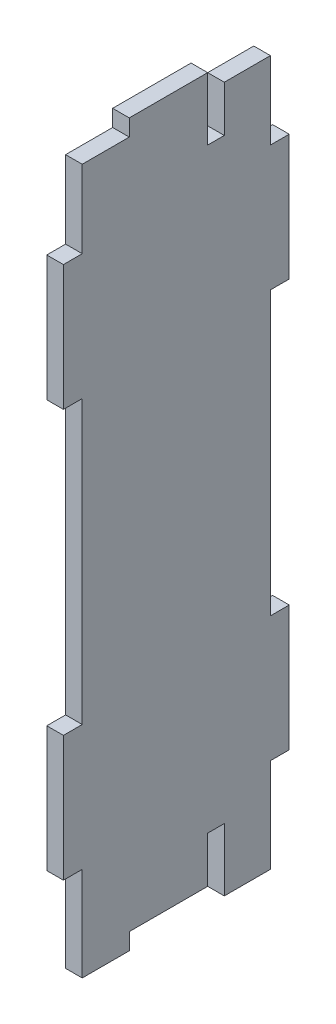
from build123d import *

# Parameters (mm, degrees)
CROQUIS1_W              = 2.65
CROQUIS1_H              = 115
SALIENTE_EXTRUIR2_DEPTH = 30
CROQUIS2_W              = 15
CROQUIS2_H              = 2.65
CROQUIS2_W_2            = 7.5
CORTAR_EXTRUIR1_DEPTH   = 2.65
CROQUIS3_W              = 2.65
CROQUIS3_H              = 20
SALIENTE_EXTRUIR3_DEPTH = 3
CROQUIS4_W              = 2.65
CROQUIS4_H              = 20
SALIENTE_EXTRUIR4_DEPTH = 3
CROQUIS5_W              = 2.65
CROQUIS5_H              = 10
CORTAR_EXTRUIR2_DEPTH   = 3


with BuildPart() as part:
    # Croquis1 → Saliente-Extruir2 (new body)
    with BuildSketch(Plane.XY):
        with Locations((118.675, 62.5)):
            Rectangle(CROQUIS1_W, CROQUIS1_H)
    extrude(amount=SALIENTE_EXTRUIR2_DEPTH)

    # Croquis2 → Cortar-Extruir1 (cut)
    with BuildSketch(Plane(origin=(120, 0, 0), x_dir=(0, 0, -1), z_dir=(1, 0, 0))):
        with Locations((-15, 6.325)):
            Rectangle(CROQUIS2_W, CROQUIS2_H)
        with Locations((-26.25, 118.675)):
            Rectangle(CROQUIS2_W_2, CROQUIS2_H)
        with Locations((-3.75, 118.675)):
            Rectangle(CROQUIS2_W_2, CROQUIS2_H)
    extrude(amount=-CORTAR_EXTRUIR1_DEPTH, mode=Mode.SUBTRACT)

    # Croquis3 → Saliente-Extruir3 (add)
    with BuildSketch(Plane(origin=(0, 0, 0), x_dir=(-1, 0, 0), z_dir=(0, 0, -1))):
        with Locations((-118.675, 95)):
            Rectangle(CROQUIS3_W, CROQUIS3_H)
        with Locations((-118.675, 30)):
            Rectangle(CROQUIS3_W, CROQUIS3_H)
    extrude(amount=SALIENTE_EXTRUIR3_DEPTH)

    # Croquis4 → Saliente-Extruir4 (add)
    with BuildSketch(Plane.XY.offset(30)):
        with Locations((118.675, 95)):
            Rectangle(CROQUIS4_W, CROQUIS4_H)
        with Locations((118.675, 30)):
            Rectangle(CROQUIS4_W, CROQUIS4_H)
    extrude(amount=SALIENTE_EXTRUIR4_DEPTH)

    # Croquis5 → Cortar-Extruir2 (cut)
    with BuildSketch(Plane(origin=(120, 0, 0), x_dir=(0, 0, -1), z_dir=(1, 0, 0))):
        with Locations((-8.675, 115)):
            Rectangle(CROQUIS5_W, CROQUIS5_H)
        with Locations((-8.675, 10)):
            Rectangle(CROQUIS5_W, CROQUIS5_H)
    extrude(amount=-CORTAR_EXTRUIR2_DEPTH, mode=Mode.SUBTRACT)


solid = part.part
